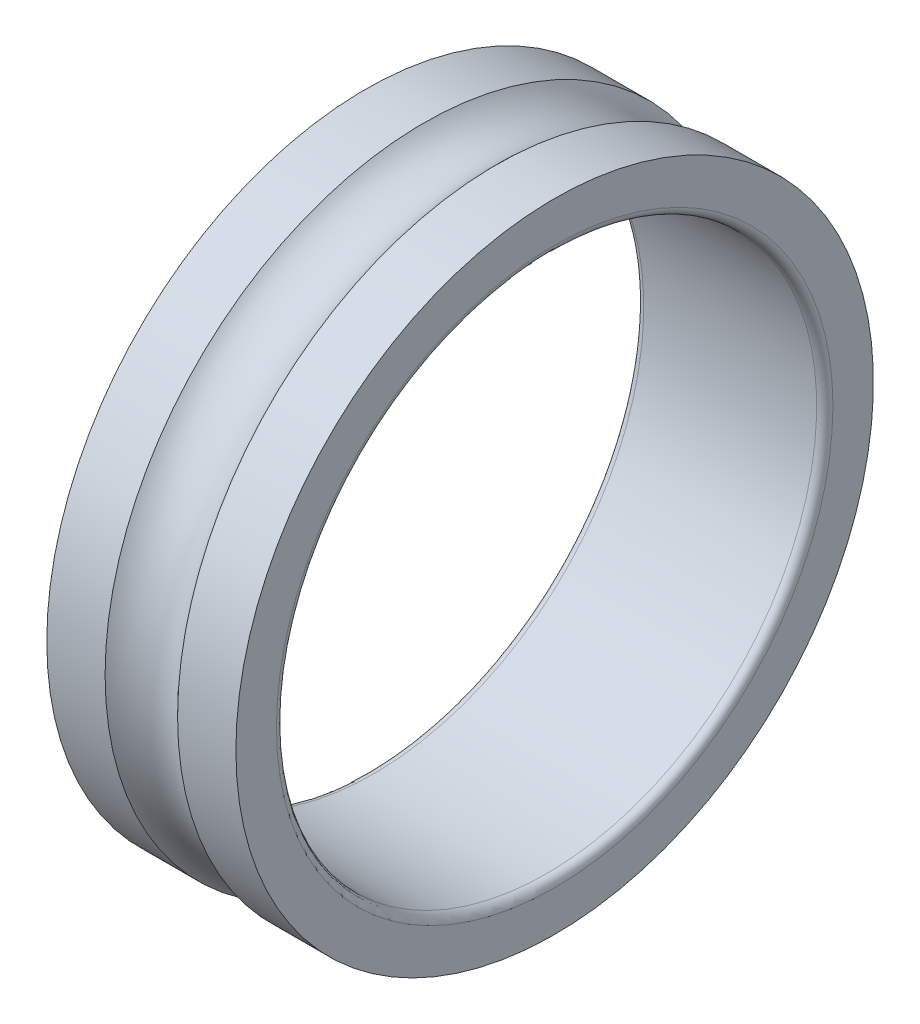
ISO-10303-21;
HEADER;
FILE_DESCRIPTION(('STEP AP214'),'2;1');
FILE_NAME('part.step','',(''),(''),'','','');
FILE_SCHEMA(('AUTOMOTIVE_DESIGN { 1 0 10303 214 1 1 1 1 }'));
ENDSEC;
DATA;
#1=APPLICATION_CONTEXT('core data for automotive mechanical design processes');
#2=APPLICATION_PROTOCOL_DEFINITION('international standard','automotive_design',2000,#1);
#3=PRODUCT_CONTEXT('',#1,'mechanical');
#4=PRODUCT('Part','Part','',(#3));
#5=PRODUCT_RELATED_PRODUCT_CATEGORY('part','',(#4));
#6=PRODUCT_DEFINITION_FORMATION('','',#4);
#7=PRODUCT_DEFINITION_CONTEXT('part definition',#1,'design');
#8=PRODUCT_DEFINITION('design','',#6,#7);
#9=PRODUCT_DEFINITION_SHAPE('','',#8);
#10=(LENGTH_UNIT() NAMED_UNIT(*) SI_UNIT(.MILLI.,.METRE.));
#11=(NAMED_UNIT(*) PLANE_ANGLE_UNIT() SI_UNIT($,.RADIAN.));
#12=(NAMED_UNIT(*) SI_UNIT($,.STERADIAN.) SOLID_ANGLE_UNIT());
#13=UNCERTAINTY_MEASURE_WITH_UNIT(LENGTH_MEASURE(1.E-05),#10,'distance_accuracy_value','');
#14=(GEOMETRIC_REPRESENTATION_CONTEXT(3) GLOBAL_UNCERTAINTY_ASSIGNED_CONTEXT((#13)) GLOBAL_UNIT_ASSIGNED_CONTEXT((#10,
#11,#12)) REPRESENTATION_CONTEXT('',''));
#15=CARTESIAN_POINT('',(0.,0.,0.));
#16=DIRECTION('',(0.,0.,1.));
#17=DIRECTION('',(1.,0.,0.));
#18=AXIS2_PLACEMENT_3D('',#15,#16,#17);
#19=CARTESIAN_POINT('',(0.299999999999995,0.,0.));
#20=DIRECTION('',(-1.,0.,0.));
#21=DIRECTION('',(0.,0.,1.));
#22=AXIS2_PLACEMENT_3D('',#19,#20,#21);
#23=TOROIDAL_SURFACE('',#22,10.3,0.3);
#24=CARTESIAN_POINT('',(0.299999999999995,0.,0.));
#25=DIRECTION('',(-1.,0.,0.));
#26=DIRECTION('',(0.,0.,1.));
#27=AXIS2_PLACEMENT_3D('',#24,#25,#26);
#28=CIRCLE('',#27,10.);
#29=CARTESIAN_POINT('',(0.299999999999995,0.,10.));
#30=VERTEX_POINT('',#29);
#31=EDGE_CURVE('E10',#30,#30,#28,.T.);
#32=ORIENTED_EDGE('',*,*,#31,.F.);
#33=EDGE_LOOP('',(#32));
#34=FACE_BOUND('',#33,.T.);
#35=CARTESIAN_POINT('',(0.,0.,0.));
#36=DIRECTION('',(-1.,0.,0.));
#37=DIRECTION('',(0.,0.,1.));
#38=AXIS2_PLACEMENT_3D('',#35,#36,#37);
#39=CIRCLE('',#38,10.3);
#40=CARTESIAN_POINT('',(0.,0.,10.3));
#41=VERTEX_POINT('',#40);
#42=EDGE_CURVE('E56',#41,#41,#39,.T.);
#43=ORIENTED_EDGE('',*,*,#42,.T.);
#44=EDGE_LOOP('',(#43));
#45=FACE_BOUND('',#44,.T.);
#46=ADVANCED_FACE('F28',(#34,#45),#23,.T.);
#47=CARTESIAN_POINT('',(0.,0.,0.));
#48=DIRECTION('',(-1.,0.,0.));
#49=DIRECTION('',(0.,0.,1.));
#50=AXIS2_PLACEMENT_3D('',#47,#48,#49);
#51=CYLINDRICAL_SURFACE('',#50,10.);
#52=CARTESIAN_POINT('',(6.7,0.,1.11022302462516E-13));
#53=DIRECTION('',(-1.,0.,0.));
#54=DIRECTION('',(0.,0.,1.));
#55=AXIS2_PLACEMENT_3D('',#52,#53,#54);
#56=CIRCLE('',#55,10.);
#57=CARTESIAN_POINT('',(6.7,0.,10.0000000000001));
#58=VERTEX_POINT('',#57);
#59=EDGE_CURVE('E34',#58,#58,#56,.T.);
#60=ORIENTED_EDGE('',*,*,#59,.F.);
#61=EDGE_LOOP('',(#60));
#62=FACE_BOUND('',#61,.T.);
#63=ORIENTED_EDGE('',*,*,#31,.T.);
#64=EDGE_LOOP('',(#63));
#65=FACE_BOUND('',#64,.T.);
#66=ADVANCED_FACE('F93',(#62,#65),#51,.F.);
#67=CARTESIAN_POINT('',(6.7,0.,1.11022302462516E-13));
#68=DIRECTION('',(-1.,0.,0.));
#69=DIRECTION('',(0.,0.,1.));
#70=AXIS2_PLACEMENT_3D('',#67,#68,#69);
#71=TOROIDAL_SURFACE('',#70,10.3,0.300000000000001);
#72=CARTESIAN_POINT('',(7.00000000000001,0.,1.11022302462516E-13));
#73=DIRECTION('',(-1.,0.,0.));
#74=DIRECTION('',(0.,0.,1.));
#75=AXIS2_PLACEMENT_3D('',#72,#73,#74);
#76=CIRCLE('',#75,10.3);
#77=CARTESIAN_POINT('',(7.00000000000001,0.,10.3000000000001));
#78=VERTEX_POINT('',#77);
#79=EDGE_CURVE('E38',#78,#78,#76,.T.);
#80=ORIENTED_EDGE('',*,*,#79,.F.);
#81=EDGE_LOOP('',(#80));
#82=FACE_BOUND('',#81,.T.);
#83=ORIENTED_EDGE('',*,*,#59,.T.);
#84=EDGE_LOOP('',(#83));
#85=FACE_BOUND('',#84,.T.);
#86=ADVANCED_FACE('F88',(#82,#85),#71,.T.);
#87=CARTESIAN_POINT('',(7.00000000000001,0.,-11.8));
#88=DIRECTION('',(-1.,0.,0.));
#89=DIRECTION('',(0.,0.,1.));
#90=AXIS2_PLACEMENT_3D('',#87,#88,#89);
#91=PLANE('',#90);
#92=CARTESIAN_POINT('',(7.00000000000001,0.,1.11022302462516E-13));
#93=DIRECTION('',(-1.,0.,0.));
#94=DIRECTION('',(0.,0.,1.));
#95=AXIS2_PLACEMENT_3D('',#92,#93,#94);
#96=CIRCLE('',#95,11.8);
#97=CARTESIAN_POINT('',(7.00000000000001,0.,11.8000000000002));
#98=VERTEX_POINT('',#97);
#99=EDGE_CURVE('E42',#98,#98,#96,.T.);
#100=ORIENTED_EDGE('',*,*,#99,.F.);
#101=EDGE_LOOP('',(#100));
#102=FACE_BOUND('',#101,.T.);
#103=ORIENTED_EDGE('',*,*,#79,.T.);
#104=EDGE_LOOP('',(#103));
#105=FACE_BOUND('',#104,.T.);
#106=ADVANCED_FACE('F82',(#102,#105),#91,.F.);
#107=CARTESIAN_POINT('',(0.,0.,0.));
#108=DIRECTION('',(-1.,0.,0.));
#109=DIRECTION('',(0.,0.,1.));
#110=AXIS2_PLACEMENT_3D('',#107,#108,#109);
#111=CYLINDRICAL_SURFACE('',#110,11.8);
#112=CARTESIAN_POINT('',(4.84164078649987,0.,0.));
#113=DIRECTION('',(-1.,0.,0.));
#114=DIRECTION('',(0.,0.,1.));
#115=AXIS2_PLACEMENT_3D('',#112,#113,#114);
#116=CIRCLE('',#115,11.8);
#117=CARTESIAN_POINT('',(4.84164078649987,0.,11.8));
#118=VERTEX_POINT('',#117);
#119=EDGE_CURVE('E47',#118,#118,#116,.T.);
#120=ORIENTED_EDGE('',*,*,#119,.F.);
#121=EDGE_LOOP('',(#120));
#122=FACE_BOUND('',#121,.T.);
#123=ORIENTED_EDGE('',*,*,#99,.T.);
#124=EDGE_LOOP('',(#123));
#125=FACE_BOUND('',#124,.T.);
#126=ADVANCED_FACE('F76',(#122,#125),#111,.T.);
#127=CARTESIAN_POINT('',(3.5,0.,0.));
#128=DIRECTION('',(-1.,0.,0.));
#129=DIRECTION('',(0.,0.,1.));
#130=AXIS2_PLACEMENT_3D('',#127,#128,#129);
#131=TOROIDAL_SURFACE('',#130,13.,1.8);
#132=CARTESIAN_POINT('',(2.15835921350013,0.,1.11022302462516E-13));
#133=DIRECTION('',(-1.,0.,0.));
#134=DIRECTION('',(0.,0.,1.));
#135=AXIS2_PLACEMENT_3D('',#132,#133,#134);
#136=CIRCLE('',#135,11.8);
#137=CARTESIAN_POINT('',(2.15835921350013,0.,11.8000000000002));
#138=VERTEX_POINT('',#137);
#139=EDGE_CURVE('E50',#138,#138,#136,.T.);
#140=ORIENTED_EDGE('',*,*,#139,.F.);
#141=EDGE_LOOP('',(#140));
#142=FACE_BOUND('',#141,.T.);
#143=ORIENTED_EDGE('',*,*,#119,.T.);
#144=EDGE_LOOP('',(#143));
#145=FACE_BOUND('',#144,.T.);
#146=ADVANCED_FACE('F70',(#142,#145),#131,.F.);
#147=CARTESIAN_POINT('',(0.,0.,0.));
#148=DIRECTION('',(-1.,0.,0.));
#149=DIRECTION('',(0.,0.,1.));
#150=AXIS2_PLACEMENT_3D('',#147,#148,#149);
#151=CYLINDRICAL_SURFACE('',#150,11.8);
#152=CARTESIAN_POINT('',(0.,0.,0.));
#153=DIRECTION('',(-1.,0.,0.));
#154=DIRECTION('',(0.,0.,1.));
#155=AXIS2_PLACEMENT_3D('',#152,#153,#154);
#156=CIRCLE('',#155,11.8);
#157=CARTESIAN_POINT('',(0.,0.,11.8));
#158=VERTEX_POINT('',#157);
#159=EDGE_CURVE('E53',#158,#158,#156,.T.);
#160=ORIENTED_EDGE('',*,*,#159,.F.);
#161=EDGE_LOOP('',(#160));
#162=FACE_BOUND('',#161,.T.);
#163=ORIENTED_EDGE('',*,*,#139,.T.);
#164=EDGE_LOOP('',(#163));
#165=FACE_BOUND('',#164,.T.);
#166=ADVANCED_FACE('F64',(#162,#165),#151,.T.);
#167=CARTESIAN_POINT('',(0.,0.,-11.8000000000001));
#168=DIRECTION('',(1.,0.,0.));
#169=DIRECTION('',(0.,0.,-1.));
#170=AXIS2_PLACEMENT_3D('',#167,#168,#169);
#171=PLANE('',#170);
#172=ORIENTED_EDGE('',*,*,#42,.F.);
#173=EDGE_LOOP('',(#172));
#174=FACE_BOUND('',#173,.T.);
#175=ORIENTED_EDGE('',*,*,#159,.T.);
#176=EDGE_LOOP('',(#175));
#177=FACE_BOUND('',#176,.T.);
#178=ADVANCED_FACE('F61',(#174,#177),#171,.F.);
#179=CLOSED_SHELL('',(#46,#66,#86,#106,#126,#146,#166,#178));
#180=MANIFOLD_SOLID_BREP('B2',#179);
#181=ADVANCED_BREP_SHAPE_REPRESENTATION('',(#18,#180),#14);
#182=SHAPE_DEFINITION_REPRESENTATION(#9,#181);
ENDSEC;
END-ISO-10303-21;
